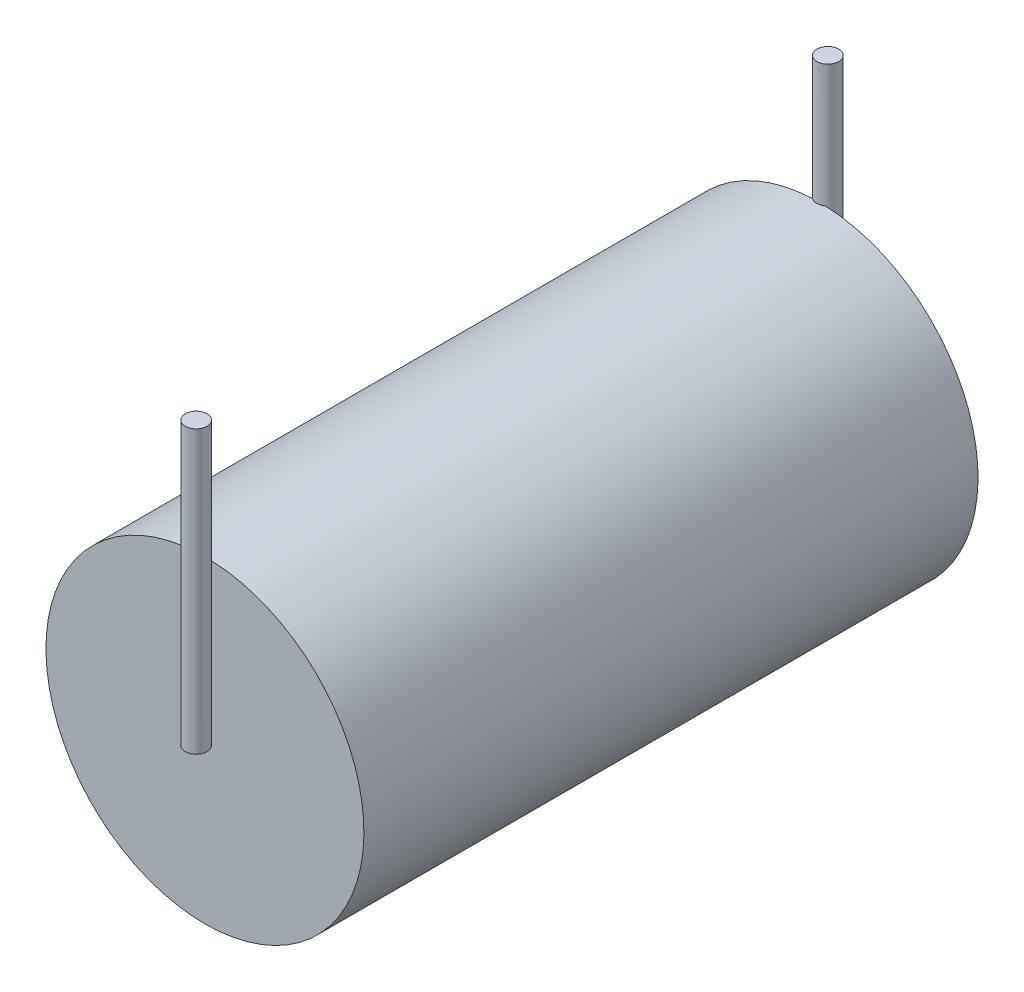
from build123d import *

# Parameters (mm, degrees)
SKETCH1_R      = 5.7531
EXTRUDE1_DEPTH = 22.225
SKETCH2_R      = 0.3937
EXTRUDE2_DEPTH = 10.1981


with BuildPart() as part:
    # Sketch1 → Extrude1 (new body)
    with BuildSketch(Plane.XY):
        Circle(SKETCH1_R)
    extrude(amount=EXTRUDE1_DEPTH)

    # Sketch2 → Extrude2 (add)
    with BuildSketch(Plane(origin=(0, 0, 0), x_dir=(1, 0, 0), z_dir=(0, 1, 0))):
        with Locations(Location((0, 0.3175, 0), (0, 0, 233.750679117))):
            Circle(SKETCH2_R)
        with Locations(Location((0, -22.5425, 0), (0, 0, 90))):
            Circle(SKETCH2_R)
    extrude(amount=EXTRUDE2_DEPTH)


solid = part.part
